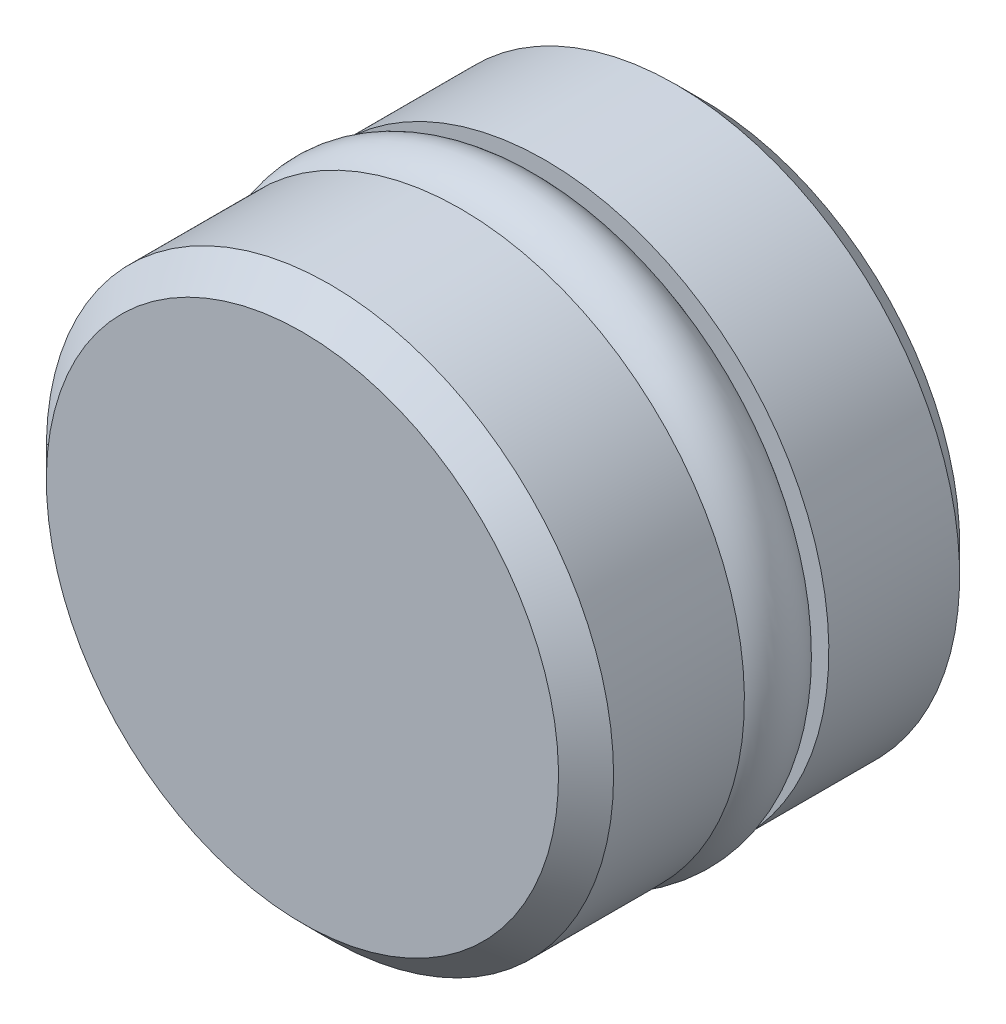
ISO-10303-21;
HEADER;
FILE_DESCRIPTION(('STEP AP214'),'2;1');
FILE_NAME('part.step','',(''),(''),'','','');
FILE_SCHEMA(('AUTOMOTIVE_DESIGN { 1 0 10303 214 1 1 1 1 }'));
ENDSEC;
DATA;
#1=APPLICATION_CONTEXT('core data for automotive mechanical design processes');
#2=APPLICATION_PROTOCOL_DEFINITION('international standard','automotive_design',2000,#1);
#3=PRODUCT_CONTEXT('',#1,'mechanical');
#4=PRODUCT('Part','Part','',(#3));
#5=PRODUCT_RELATED_PRODUCT_CATEGORY('part','',(#4));
#6=PRODUCT_DEFINITION_FORMATION('','',#4);
#7=PRODUCT_DEFINITION_CONTEXT('part definition',#1,'design');
#8=PRODUCT_DEFINITION('design','',#6,#7);
#9=PRODUCT_DEFINITION_SHAPE('','',#8);
#10=(LENGTH_UNIT() NAMED_UNIT(*) SI_UNIT(.MILLI.,.METRE.));
#11=(NAMED_UNIT(*) PLANE_ANGLE_UNIT() SI_UNIT($,.RADIAN.));
#12=(NAMED_UNIT(*) SI_UNIT($,.STERADIAN.) SOLID_ANGLE_UNIT());
#13=UNCERTAINTY_MEASURE_WITH_UNIT(LENGTH_MEASURE(1.E-05),#10,'distance_accuracy_value','');
#14=(GEOMETRIC_REPRESENTATION_CONTEXT(3) GLOBAL_UNCERTAINTY_ASSIGNED_CONTEXT((#13)) GLOBAL_UNIT_ASSIGNED_CONTEXT((#10,
#11,#12)) REPRESENTATION_CONTEXT('',''));
#15=CARTESIAN_POINT('',(0.,0.,0.));
#16=DIRECTION('',(0.,0.,1.));
#17=DIRECTION('',(1.,0.,0.));
#18=AXIS2_PLACEMENT_3D('',#15,#16,#17);
#19=CARTESIAN_POINT('',(0.,0.,5.5499));
#20=DIRECTION('',(0.,0.,-1.));
#21=DIRECTION('',(-1.,0.,0.));
#22=AXIS2_PLACEMENT_3D('',#19,#20,#21);
#23=TOROIDAL_SURFACE('',#22,6.8834,1.1684);
#24=CARTESIAN_POINT('',(-8.0518,0.,5.5499));
#25=VERTEX_POINT('',#24);
#26=VERTEX_LOOP('',#25);
#27=FACE_BOUND('',#26,.T.);
#28=ADVANCED_FACE('P0_F12',(#27),#23,.T.);
#29=CLOSED_SHELL('',(#28));
#30=MANIFOLD_SOLID_BREP('P0_B1',#29);
#31=CARTESIAN_POINT('',(0.,0.,6.58522979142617));
#32=DIRECTION('',(0.,0.,-1.));
#33=DIRECTION('',(0.,1.,0.));
#34=AXIS2_PLACEMENT_3D('',#31,#32,#33);
#35=CONICAL_SURFACE('',#34,2.58064000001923,1.02747003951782);
#36=CARTESIAN_POINT('',(0.,0.,6.5852297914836));
#37=DIRECTION('',(0.,0.,-1.));
#38=DIRECTION('',(0.,1.,0.));
#39=AXIS2_PLACEMENT_3D('',#36,#37,#38);
#40=CIRCLE('',#39,2.58063999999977);
#41=CARTESIAN_POINT('',(0.,2.58063999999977,6.5852297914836));
#42=VERTEX_POINT('',#41);
#43=EDGE_CURVE('P1_E77',#42,#42,#40,.T.);
#44=ORIENTED_EDGE('',*,*,#43,.T.);
#45=EDGE_LOOP('',(#44));
#46=FACE_BOUND('',#45,.T.);
#47=CARTESIAN_POINT('',(1.13686837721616E-10,0.,8.14383350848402));
#48=VERTEX_POINT('',#47);
#49=VERTEX_LOOP('',#48);
#50=FACE_BOUND('',#49,.T.);
#51=ADVANCED_FACE('P1_F15',(#46,#50),#35,.F.);
#52=CARTESIAN_POINT('',(0.,0.,3.2926148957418));
#53=DIRECTION('',(0.,0.,-1.));
#54=DIRECTION('',(0.,1.,0.));
#55=AXIS2_PLACEMENT_3D('',#52,#53,#54);
#56=CYLINDRICAL_SURFACE('',#55,2.58063999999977);
#57=ORIENTED_EDGE('',*,*,#43,.F.);
#58=EDGE_LOOP('',(#57));
#59=FACE_BOUND('',#58,.T.);
#60=CARTESIAN_POINT('',(0.,0.,0.));
#61=DIRECTION('',(0.,0.,-1.));
#62=DIRECTION('',(0.,1.,0.));
#63=AXIS2_PLACEMENT_3D('',#60,#61,#62);
#64=CIRCLE('',#63,2.58063999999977);
#65=CARTESIAN_POINT('',(0.,2.58063999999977,0.));
#66=VERTEX_POINT('',#65);
#67=EDGE_CURVE('P1_E68',#66,#66,#64,.F.);
#68=ORIENTED_EDGE('',*,*,#67,.F.);
#69=EDGE_LOOP('',(#68));
#70=FACE_BOUND('',#69,.T.);
#71=ADVANCED_FACE('P1_F27',(#59,#70),#56,.F.);
#72=CARTESIAN_POINT('',(4.83361999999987,0.,0.));
#73=DIRECTION('',(0.,0.,-1.));
#74=DIRECTION('',(-1.,0.,0.));
#75=AXIS2_PLACEMENT_3D('',#72,#73,#74);
#76=PLANE('',#75);
#77=ORIENTED_EDGE('',*,*,#67,.T.);
#78=EDGE_LOOP('',(#77));
#79=FACE_BOUND('',#78,.T.);
#80=CARTESIAN_POINT('',(0.,0.,0.));
#81=DIRECTION('',(0.,0.,1.));
#82=DIRECTION('',(0.,-1.,0.));
#83=AXIS2_PLACEMENT_3D('',#80,#81,#82);
#84=CIRCLE('',#83,7.0866);
#85=CARTESIAN_POINT('',(0.,-7.0866,0.));
#86=VERTEX_POINT('',#85);
#87=EDGE_CURVE('P1_E71',#86,#86,#84,.T.);
#88=ORIENTED_EDGE('',*,*,#87,.F.);
#89=EDGE_LOOP('',(#88));
#90=FACE_BOUND('',#89,.T.);
#91=ADVANCED_FACE('P1_F34',(#79,#90),#76,.T.);
#92=CARTESIAN_POINT('',(0.,0.,0.762));
#93=DIRECTION('',(0.,0.,1.));
#94=DIRECTION('',(0.,-1.,0.));
#95=AXIS2_PLACEMENT_3D('',#92,#93,#94);
#96=CONICAL_SURFACE('',#95,7.8486,0.785398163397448);
#97=ORIENTED_EDGE('',*,*,#87,.T.);
#98=EDGE_LOOP('',(#97));
#99=FACE_BOUND('',#98,.T.);
#100=CARTESIAN_POINT('',(0.,0.,0.762));
#101=DIRECTION('',(0.,0.,-1.));
#102=DIRECTION('',(0.,1.,0.));
#103=AXIS2_PLACEMENT_3D('',#100,#101,#102);
#104=CIRCLE('',#103,7.8486);
#105=CARTESIAN_POINT('',(0.,7.8486,0.761999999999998));
#106=VERTEX_POINT('',#105);
#107=EDGE_CURVE('P1_E72',#106,#106,#104,.F.);
#108=ORIENTED_EDGE('',*,*,#107,.F.);
#109=EDGE_LOOP('',(#108));
#110=FACE_BOUND('',#109,.T.);
#111=ADVANCED_FACE('P1_F49',(#99,#110),#96,.T.);
#112=CARTESIAN_POINT('',(0.,0.,2.55905));
#113=DIRECTION('',(0.,0.,-1.));
#114=DIRECTION('',(0.,1.,0.));
#115=AXIS2_PLACEMENT_3D('',#112,#113,#114);
#116=CYLINDRICAL_SURFACE('',#115,7.8486);
#117=ORIENTED_EDGE('',*,*,#107,.T.);
#118=EDGE_LOOP('',(#117));
#119=FACE_BOUND('',#118,.T.);
#120=CARTESIAN_POINT('',(0.,0.,4.3815));
#121=DIRECTION('',(0.,0.,-1.));
#122=DIRECTION('',(0.,1.,0.));
#123=AXIS2_PLACEMENT_3D('',#120,#121,#122);
#124=CIRCLE('',#123,7.8486);
#125=CARTESIAN_POINT('',(0.,7.8486,4.3815));
#126=VERTEX_POINT('',#125);
#127=EDGE_CURVE('P1_E75',#126,#126,#124,.F.);
#128=ORIENTED_EDGE('',*,*,#127,.F.);
#129=EDGE_LOOP('',(#128));
#130=FACE_BOUND('',#129,.T.);
#131=ADVANCED_FACE('P1_F43',(#119,#130),#116,.T.);
#132=CARTESIAN_POINT('',(6.77545,0.,4.3815));
#133=DIRECTION('',(0.,0.,1.));
#134=DIRECTION('',(1.,0.,0.));
#135=AXIS2_PLACEMENT_3D('',#132,#133,#134);
#136=PLANE('',#135);
#137=ORIENTED_EDGE('',*,*,#127,.T.);
#138=EDGE_LOOP('',(#137));
#139=FACE_BOUND('',#138,.T.);
#140=CARTESIAN_POINT('',(0.,0.,4.3815));
#141=DIRECTION('',(0.,0.,-1.));
#142=DIRECTION('',(-1.,0.,0.));
#143=AXIS2_PLACEMENT_3D('',#140,#141,#142);
#144=CIRCLE('',#143,5.715);
#145=CARTESIAN_POINT('',(-5.715,0.,4.3815));
#146=VERTEX_POINT('',#145);
#147=EDGE_CURVE('P1_E81',#146,#146,#144,.T.);
#148=ORIENTED_EDGE('',*,*,#147,.T.);
#149=EDGE_LOOP('',(#148));
#150=FACE_BOUND('',#149,.T.);
#151=ADVANCED_FACE('P1_F39',(#139,#150),#136,.T.);
#152=CARTESIAN_POINT('',(0.,0.,0.));
#153=DIRECTION('',(0.,0.,-1.));
#154=DIRECTION('',(-1.,0.,0.));
#155=AXIS2_PLACEMENT_3D('',#152,#153,#154);
#156=CYLINDRICAL_SURFACE('',#155,5.715);
#157=ORIENTED_EDGE('',*,*,#147,.F.);
#158=EDGE_LOOP('',(#157));
#159=FACE_BOUND('',#158,.T.);
#160=CARTESIAN_POINT('',(0.,0.,6.7183));
#161=DIRECTION('',(0.,0.,-1.));
#162=DIRECTION('',(-1.,0.,0.));
#163=AXIS2_PLACEMENT_3D('',#160,#161,#162);
#164=CIRCLE('',#163,5.715);
#165=CARTESIAN_POINT('',(-5.715,0.,6.7183));
#166=VERTEX_POINT('',#165);
#167=EDGE_CURVE('P1_E18',#166,#166,#164,.F.);
#168=ORIENTED_EDGE('',*,*,#167,.F.);
#169=EDGE_LOOP('',(#168));
#170=FACE_BOUND('',#169,.T.);
#171=ADVANCED_FACE('P1_F29',(#159,#170),#156,.T.);
#172=CARTESIAN_POINT('',(3.5433,0.,11.0998));
#173=DIRECTION('',(0.,0.,1.));
#174=DIRECTION('',(1.,0.,0.));
#175=AXIS2_PLACEMENT_3D('',#172,#173,#174);
#176=PLANE('',#175);
#177=CARTESIAN_POINT('',(0.,0.,11.0998));
#178=DIRECTION('',(0.,0.,-1.));
#179=DIRECTION('',(0.,1.,0.));
#180=AXIS2_PLACEMENT_3D('',#177,#178,#179);
#181=CIRCLE('',#180,7.0866);
#182=CARTESIAN_POINT('',(0.,7.0866,11.0998));
#183=VERTEX_POINT('',#182);
#184=EDGE_CURVE('P1_E10',#183,#183,#181,.F.);
#185=ORIENTED_EDGE('',*,*,#184,.T.);
#186=EDGE_LOOP('',(#185));
#187=FACE_BOUND('',#186,.T.);
#188=ADVANCED_FACE('P1_F38',(#187),#176,.T.);
#189=CARTESIAN_POINT('',(0.,0.,10.3378));
#190=DIRECTION('',(0.,0.,-1.));
#191=DIRECTION('',(0.,1.,0.));
#192=AXIS2_PLACEMENT_3D('',#189,#190,#191);
#193=CONICAL_SURFACE('',#192,7.8486,0.785398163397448);
#194=CARTESIAN_POINT('',(0.,0.,10.3378));
#195=DIRECTION('',(0.,0.,-1.));
#196=DIRECTION('',(1.,0.,0.));
#197=AXIS2_PLACEMENT_3D('',#194,#195,#196);
#198=CIRCLE('',#197,7.8486);
#199=CARTESIAN_POINT('',(7.8486,0.,10.3378));
#200=VERTEX_POINT('',#199);
#201=EDGE_CURVE('P1_E22',#200,#200,#198,.F.);
#202=ORIENTED_EDGE('',*,*,#201,.T.);
#203=EDGE_LOOP('',(#202));
#204=FACE_BOUND('',#203,.T.);
#205=ORIENTED_EDGE('',*,*,#184,.F.);
#206=EDGE_LOOP('',(#205));
#207=FACE_BOUND('',#206,.T.);
#208=ADVANCED_FACE('P1_F95',(#204,#207),#193,.T.);
#209=CARTESIAN_POINT('',(0.,0.,8.54075));
#210=DIRECTION('',(0.,0.,-1.));
#211=DIRECTION('',(0.,1.,0.));
#212=AXIS2_PLACEMENT_3D('',#209,#210,#211);
#213=CYLINDRICAL_SURFACE('',#212,7.8486);
#214=CARTESIAN_POINT('',(0.,0.,6.7183));
#215=DIRECTION('',(0.,0.,-1.));
#216=DIRECTION('',(0.,1.,0.));
#217=AXIS2_PLACEMENT_3D('',#214,#215,#216);
#218=CIRCLE('',#217,7.8486);
#219=CARTESIAN_POINT('',(0.,7.8486,6.7183));
#220=VERTEX_POINT('',#219);
#221=EDGE_CURVE('P1_E99',#220,#220,#218,.F.);
#222=ORIENTED_EDGE('',*,*,#221,.T.);
#223=EDGE_LOOP('',(#222));
#224=FACE_BOUND('',#223,.T.);
#225=ORIENTED_EDGE('',*,*,#201,.F.);
#226=EDGE_LOOP('',(#225));
#227=FACE_BOUND('',#226,.T.);
#228=ADVANCED_FACE('P1_F90',(#224,#227),#213,.T.);
#229=CARTESIAN_POINT('',(6.77545,0.,6.7183));
#230=DIRECTION('',(0.,0.,-1.));
#231=DIRECTION('',(-1.,0.,0.));
#232=AXIS2_PLACEMENT_3D('',#229,#230,#231);
#233=PLANE('',#232);
#234=ORIENTED_EDGE('',*,*,#221,.F.);
#235=EDGE_LOOP('',(#234));
#236=FACE_BOUND('',#235,.T.);
#237=ORIENTED_EDGE('',*,*,#167,.T.);
#238=EDGE_LOOP('',(#237));
#239=FACE_BOUND('',#238,.T.);
#240=ADVANCED_FACE('P1_F55',(#236,#239),#233,.T.);
#241=CLOSED_SHELL('',(#51,#71,#91,#111,#131,#151,#171,#188,#208,#228,#240));
#242=MANIFOLD_SOLID_BREP('P1_B1',#241);
#243=ADVANCED_BREP_SHAPE_REPRESENTATION('',(#18,#30,#242),#14);
#244=SHAPE_DEFINITION_REPRESENTATION(#9,#243);
ENDSEC;
END-ISO-10303-21;
